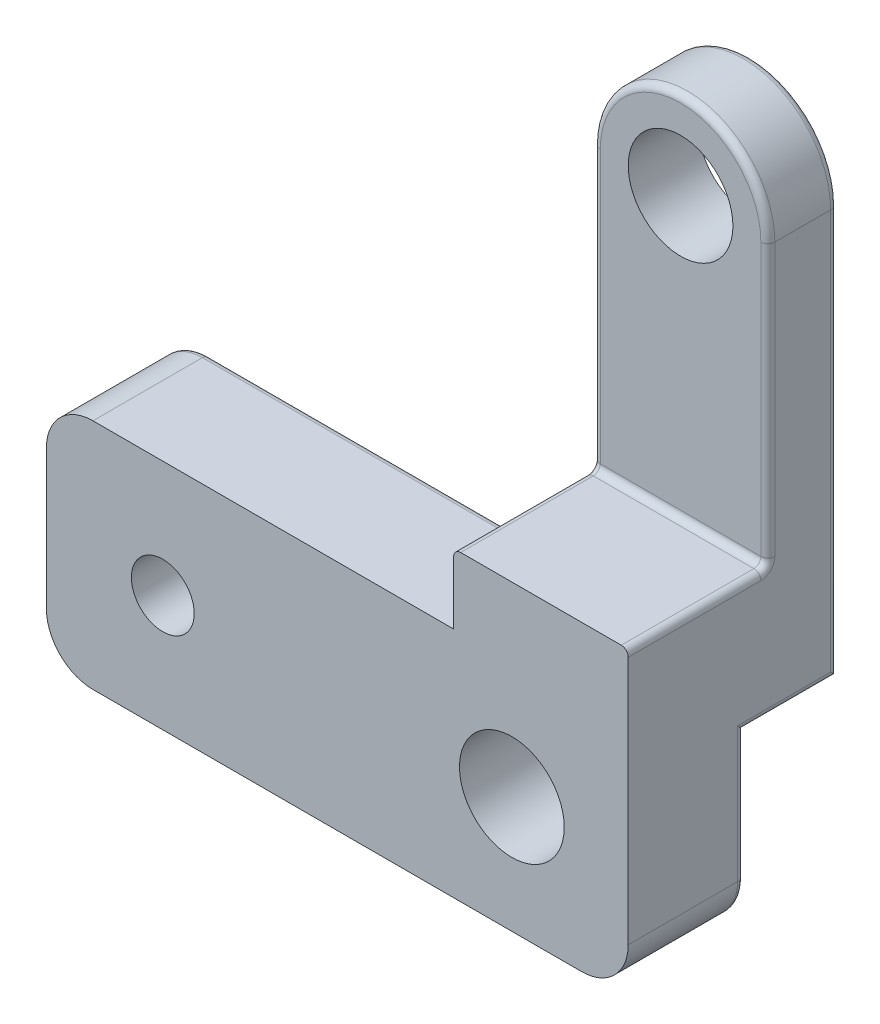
ISO-10303-21;
HEADER;
FILE_DESCRIPTION(('STEP AP214'),'2;1');
FILE_NAME('part.step','',(''),(''),'','','');
FILE_SCHEMA(('AUTOMOTIVE_DESIGN { 1 0 10303 214 1 1 1 1 }'));
ENDSEC;
DATA;
#1=APPLICATION_CONTEXT('core data for automotive mechanical design processes');
#2=APPLICATION_PROTOCOL_DEFINITION('international standard','automotive_design',2000,#1);
#3=PRODUCT_CONTEXT('',#1,'mechanical');
#4=PRODUCT('Part','Part','',(#3));
#5=PRODUCT_RELATED_PRODUCT_CATEGORY('part','',(#4));
#6=PRODUCT_DEFINITION_FORMATION('','',#4);
#7=PRODUCT_DEFINITION_CONTEXT('part definition',#1,'design');
#8=PRODUCT_DEFINITION('design','',#6,#7);
#9=PRODUCT_DEFINITION_SHAPE('','',#8);
#10=(LENGTH_UNIT() NAMED_UNIT(*) SI_UNIT(.MILLI.,.METRE.));
#11=(NAMED_UNIT(*) PLANE_ANGLE_UNIT() SI_UNIT($,.RADIAN.));
#12=(NAMED_UNIT(*) SI_UNIT($,.STERADIAN.) SOLID_ANGLE_UNIT());
#13=UNCERTAINTY_MEASURE_WITH_UNIT(LENGTH_MEASURE(1.E-05),#10,'distance_accuracy_value','');
#14=(GEOMETRIC_REPRESENTATION_CONTEXT(3) GLOBAL_UNCERTAINTY_ASSIGNED_CONTEXT((#13)) GLOBAL_UNIT_ASSIGNED_CONTEXT((#10,
#11,#12)) REPRESENTATION_CONTEXT('',''));
#15=CARTESIAN_POINT('',(0.,0.,0.));
#16=DIRECTION('',(0.,0.,1.));
#17=DIRECTION('',(1.,0.,0.));
#18=AXIS2_PLACEMENT_3D('',#15,#16,#17);
#19=CARTESIAN_POINT('',(6.35,3.175,9.525));
#20=DIRECTION('',(-1.,0.,0.));
#21=DIRECTION('',(0.,0.,-1.));
#22=AXIS2_PLACEMENT_3D('',#19,#20,#21);
#23=PLANE('',#22);
#24=CARTESIAN_POINT('',(6.35,10.541,2.286));
#25=DIRECTION('',(1.,0.,0.));
#26=DIRECTION('',(0.,0.,-1.));
#27=AXIS2_PLACEMENT_3D('',#24,#25,#26);
#28=CIRCLE('',#27,0.762);
#29=CARTESIAN_POINT('',(6.35,9.779,2.286));
#30=VERTEX_POINT('',#29);
#31=CARTESIAN_POINT('',(6.35,10.541,1.524));
#32=VERTEX_POINT('',#31);
#33=EDGE_CURVE('E300',#30,#32,#28,.T.);
#34=ORIENTED_EDGE('',*,*,#33,.T.);
#35=DIRECTION('',(0.,-1.,0.));
#36=VECTOR('',#35,1.);
#37=CARTESIAN_POINT('',(6.35,10.16,1.524));
#38=LINE('',#37,#36);
#39=CARTESIAN_POINT('',(6.35,25.4,1.524));
#40=VERTEX_POINT('',#39);
#41=EDGE_CURVE('E302',#40,#32,#38,.T.);
#42=ORIENTED_EDGE('',*,*,#41,.F.);
#43=DIRECTION('',(0.,0.,-1.));
#44=VECTOR('',#43,1.);
#45=CARTESIAN_POINT('',(6.35,25.4,9.526));
#46=LINE('',#45,#44);
#47=CARTESIAN_POINT('',(6.35,25.4,-1.524));
#48=VERTEX_POINT('',#47);
#49=EDGE_CURVE('E239',#40,#48,#46,.T.);
#50=ORIENTED_EDGE('',*,*,#49,.T.);
#51=DIRECTION('',(0.,-1.,0.));
#52=VECTOR('',#51,1.);
#53=CARTESIAN_POINT('',(6.35000000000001,25.4,-1.524));
#54=LINE('',#53,#52);
#55=CARTESIAN_POINT('',(6.35000000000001,6.12371823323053,-1.524));
#56=VERTEX_POINT('',#55);
#57=EDGE_CURVE('E297',#56,#48,#54,.F.);
#58=ORIENTED_EDGE('',*,*,#57,.F.);
#59=DIRECTION('',(0.,0.,1.));
#60=VECTOR('',#59,1.);
#61=CARTESIAN_POINT('',(6.35,6.12371823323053,9.525));
#62=LINE('',#61,#60);
#63=CARTESIAN_POINT('',(6.35,6.12371823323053,3.20782867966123));
#64=VERTEX_POINT('',#63);
#65=EDGE_CURVE('E295',#64,#56,#62,.F.);
#66=ORIENTED_EDGE('',*,*,#65,.F.);
#67=CARTESIAN_POINT('',(6.35,5.969,3.556));
#68=DIRECTION('',(1.,0.,0.));
#69=DIRECTION('',(0.,0.,-1.));
#70=AXIS2_PLACEMENT_3D('',#67,#68,#69);
#71=CIRCLE('',#70,0.381);
#72=CARTESIAN_POINT('',(6.35,6.35,3.556));
#73=VERTEX_POINT('',#72);
#74=EDGE_CURVE('E42',#73,#64,#71,.F.);
#75=ORIENTED_EDGE('',*,*,#74,.F.);
#76=DIRECTION('',(0.,0.,-1.));
#77=VECTOR('',#76,1.);
#78=CARTESIAN_POINT('',(6.35,6.35,9.525));
#79=LINE('',#78,#77);
#80=CARTESIAN_POINT('',(6.35,6.35,9.525));
#81=VERTEX_POINT('',#80);
#82=EDGE_CURVE('E220',#81,#73,#79,.T.);
#83=ORIENTED_EDGE('',*,*,#82,.F.);
#84=DIRECTION('',(0.,-1.,0.));
#85=VECTOR('',#84,1.);
#86=CARTESIAN_POINT('',(6.35,6.35,9.525));
#87=LINE('',#86,#85);
#88=CARTESIAN_POINT('',(6.35,9.779,9.525));
#89=VERTEX_POINT('',#88);
#90=EDGE_CURVE('E229',#89,#81,#87,.T.);
#91=ORIENTED_EDGE('',*,*,#90,.F.);
#92=DIRECTION('',(0.,0.,-1.));
#93=VECTOR('',#92,1.);
#94=CARTESIAN_POINT('',(6.35,9.779,9.525));
#95=LINE('',#94,#93);
#96=EDGE_CURVE('E305',#30,#89,#95,.F.);
#97=ORIENTED_EDGE('',*,*,#96,.F.);
#98=EDGE_LOOP('',(#34,#42,#50,#58,#66,#75,#83,#91,#97));
#99=FACE_BOUND('',#98,.T.);
#100=ADVANCED_FACE('F32',(#99),#23,.T.);
#101=CARTESIAN_POINT('',(0.,3.175,6.35));
#102=DIRECTION('',(0.,-1.,0.));
#103=DIRECTION('',(0.,0.,1.));
#104=AXIS2_PLACEMENT_3D('',#101,#102,#103);
#105=PLANE('',#104);
#106=DIRECTION('',(-1.,0.,0.));
#107=VECTOR('',#106,1.);
#108=CARTESIAN_POINT('',(0.,3.175,3.175));
#109=LINE('',#108,#107);
#110=CARTESIAN_POINT('',(15.494,3.175,3.175));
#111=VERTEX_POINT('',#110);
#112=CARTESIAN_POINT('',(15.24,3.175,3.175));
#113=VERTEX_POINT('',#112);
#114=EDGE_CURVE('E246',#111,#113,#109,.T.);
#115=ORIENTED_EDGE('',*,*,#114,.T.);
#116=DIRECTION('',(0.,0.,1.));
#117=VECTOR('',#116,1.);
#118=CARTESIAN_POINT('',(15.24,3.175,6.35));
#119=LINE('',#118,#117);
#120=CARTESIAN_POINT('',(15.24,3.175,-1.85233797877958));
#121=VERTEX_POINT('',#120);
#122=EDGE_CURVE('E362',#121,#113,#119,.T.);
#123=ORIENTED_EDGE('',*,*,#122,.F.);
#124=CARTESIAN_POINT('',(15.4601272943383,3.175,-1.905));
#125=CARTESIAN_POINT('',(15.4326635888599,3.175,-1.90501093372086));
#126=CARTESIAN_POINT('',(15.405163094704,3.175,-1.90269112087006));
#127=CARTESIAN_POINT('',(15.3514785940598,3.175,-1.8935706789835));
#128=CARTESIAN_POINT('',(15.3252793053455,3.175,-1.88685962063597));
#129=CARTESIAN_POINT('',(15.2896385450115,3.175,-1.87443106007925));
#130=CARTESIAN_POINT('',(15.2795458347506,3.175,-1.87051977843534));
#131=CARTESIAN_POINT('',(15.2595759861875,3.175,-1.86197162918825));
#132=CARTESIAN_POINT('',(15.2497012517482,3.175,-1.85732914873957));
#133=CARTESIAN_POINT('',(15.24,3.175,-1.8523379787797));
#134=B_SPLINE_CURVE_WITH_KNOTS('',3,(#124,#125,#126,#127,#128,#129,#130,#131,#132,#133),
.UNSPECIFIED.,.F.,.F.,(4,2,2,2,4),(0.,0.0823654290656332,0.16310108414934,0.195551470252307,
0.228264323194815),.UNSPECIFIED.);
#135=CARTESIAN_POINT('',(15.4601272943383,3.175,-1.905));
#136=VERTEX_POINT('',#135);
#137=EDGE_CURVE('E354',#136,#121,#134,.T.);
#138=ORIENTED_EDGE('',*,*,#137,.F.);
#139=DIRECTION('',(1.,0.,0.));
#140=VECTOR('',#139,1.);
#141=CARTESIAN_POINT('',(6.35000000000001,3.175,-1.905));
#142=LINE('',#141,#140);
#143=CARTESIAN_POINT('',(15.494,3.175,-1.905));
#144=VERTEX_POINT('',#143);
#145=EDGE_CURVE('E243',#136,#144,#142,.T.);
#146=ORIENTED_EDGE('',*,*,#145,.T.);
#147=DIRECTION('',(0.,0.,1.));
#148=VECTOR('',#147,1.);
#149=CARTESIAN_POINT('',(15.494,3.175,-1.905));
#150=LINE('',#149,#148);
#151=EDGE_CURVE('E595',#111,#144,#150,.F.);
#152=ORIENTED_EDGE('',*,*,#151,.F.);
#153=EDGE_LOOP('',(#115,#123,#138,#146,#152));
#154=FACE_BOUND('',#153,.T.);
#155=ADVANCED_FACE('F368',(#154),#105,.T.);
#156=CARTESIAN_POINT('',(15.875,-6.35,3.175));
#157=DIRECTION('',(-1.,0.,0.));
#158=DIRECTION('',(0.,0.,-1.));
#159=AXIS2_PLACEMENT_3D('',#156,#157,#158);
#160=PLANE('',#159);
#161=DIRECTION('',(0.,0.,1.));
#162=VECTOR('',#161,1.);
#163=CARTESIAN_POINT('',(15.875,3.556,3.175));
#164=LINE('',#163,#162);
#165=CARTESIAN_POINT('',(15.875,3.556,-1.524));
#166=VERTEX_POINT('',#165);
#167=CARTESIAN_POINT('',(15.875,3.556,3.556));
#168=VERTEX_POINT('',#167);
#169=EDGE_CURVE('E310',#166,#168,#164,.T.);
#170=ORIENTED_EDGE('',*,*,#169,.F.);
#171=DIRECTION('',(0.,-1.,0.));
#172=VECTOR('',#171,1.);
#173=CARTESIAN_POINT('',(15.875,-6.35,-1.524));
#174=LINE('',#173,#172);
#175=CARTESIAN_POINT('',(15.875,25.4,-1.524));
#176=VERTEX_POINT('',#175);
#177=EDGE_CURVE('E313',#176,#166,#174,.T.);
#178=ORIENTED_EDGE('',*,*,#177,.F.);
#179=DIRECTION('',(0.,0.,-1.));
#180=VECTOR('',#179,1.);
#181=CARTESIAN_POINT('',(15.875,25.4,9.526));
#182=LINE('',#181,#180);
#183=CARTESIAN_POINT('',(15.875,25.4,1.524));
#184=VERTEX_POINT('',#183);
#185=EDGE_CURVE('E503',#184,#176,#182,.T.);
#186=ORIENTED_EDGE('',*,*,#185,.F.);
#187=DIRECTION('',(0.,-1.,0.));
#188=VECTOR('',#187,1.);
#189=CARTESIAN_POINT('',(15.875,-6.35,1.524));
#190=LINE('',#189,#188);
#191=CARTESIAN_POINT('',(15.875,10.541,1.524));
#192=VERTEX_POINT('',#191);
#193=EDGE_CURVE('E316',#192,#184,#190,.F.);
#194=ORIENTED_EDGE('',*,*,#193,.F.);
#195=CARTESIAN_POINT('',(15.875,10.541,2.286));
#196=DIRECTION('',(1.,0.,0.));
#197=DIRECTION('',(0.,0.,-1.));
#198=AXIS2_PLACEMENT_3D('',#195,#196,#197);
#199=CIRCLE('',#198,0.762);
#200=CARTESIAN_POINT('',(15.875,9.779,2.286));
#201=VERTEX_POINT('',#200);
#202=EDGE_CURVE('E319',#192,#201,#199,.F.);
#203=ORIENTED_EDGE('',*,*,#202,.T.);
#204=DIRECTION('',(0.,0.,-1.));
#205=VECTOR('',#204,1.);
#206=CARTESIAN_POINT('',(15.875,9.779,1.905));
#207=LINE('',#206,#205);
#208=CARTESIAN_POINT('',(15.875,9.779,9.525));
#209=VERTEX_POINT('',#208);
#210=EDGE_CURVE('E322',#209,#201,#207,.T.);
#211=ORIENTED_EDGE('',*,*,#210,.F.);
#212=DIRECTION('',(0.,1.,0.));
#213=VECTOR('',#212,1.);
#214=CARTESIAN_POINT('',(15.875,-6.35,9.525));
#215=LINE('',#214,#213);
#216=CARTESIAN_POINT('',(15.875,-3.81,9.525));
#217=VERTEX_POINT('',#216);
#218=EDGE_CURVE('E226',#217,#209,#215,.T.);
#219=ORIENTED_EDGE('',*,*,#218,.F.);
#220=DIRECTION('',(0.,0.,1.));
#221=VECTOR('',#220,1.);
#222=CARTESIAN_POINT('',(15.875,-3.81,3.175));
#223=LINE('',#222,#221);
#224=CARTESIAN_POINT('',(15.875,-3.81,3.556));
#225=VERTEX_POINT('',#224);
#226=EDGE_CURVE('E265',#225,#217,#223,.T.);
#227=ORIENTED_EDGE('',*,*,#226,.F.);
#228=DIRECTION('',(0.,1.,0.));
#229=VECTOR('',#228,1.);
#230=CARTESIAN_POINT('',(15.875,-6.35,3.556));
#231=LINE('',#230,#229);
#232=EDGE_CURVE('E565',#168,#225,#231,.F.);
#233=ORIENTED_EDGE('',*,*,#232,.F.);
#234=EDGE_LOOP('',(#170,#178,#186,#194,#203,#211,#219,#227,#233));
#235=FACE_BOUND('',#234,.T.);
#236=ADVANCED_FACE('F373',(#235),#160,.F.);
#237=CARTESIAN_POINT('',(-15.875,6.35,3.175));
#238=DIRECTION('',(0.,-1.,0.));
#239=DIRECTION('',(0.,0.,1.));
#240=AXIS2_PLACEMENT_3D('',#237,#238,#239);
#241=PLANE('',#240);
#242=DIRECTION('',(0.,0.,1.));
#243=VECTOR('',#242,1.);
#244=CARTESIAN_POINT('',(-13.335,6.35,3.175));
#245=LINE('',#244,#243);
#246=CARTESIAN_POINT('',(-13.335,6.35,9.525));
#247=VERTEX_POINT('',#246);
#248=CARTESIAN_POINT('',(-13.335,6.35,3.556));
#249=VERTEX_POINT('',#248);
#250=EDGE_CURVE('E223',#247,#249,#245,.F.);
#251=ORIENTED_EDGE('',*,*,#250,.F.);
#252=DIRECTION('',(-1.,0.,0.));
#253=VECTOR('',#252,1.);
#254=CARTESIAN_POINT('',(-15.875,6.35,9.525));
#255=LINE('',#254,#253);
#256=EDGE_CURVE('E216',#81,#247,#255,.T.);
#257=ORIENTED_EDGE('',*,*,#256,.F.);
#258=ORIENTED_EDGE('',*,*,#82,.T.);
#259=DIRECTION('',(-1.,0.,0.));
#260=VECTOR('',#259,1.);
#261=CARTESIAN_POINT('',(-15.875,6.35,3.556));
#262=LINE('',#261,#260);
#263=EDGE_CURVE('E55',#249,#73,#262,.F.);
#264=ORIENTED_EDGE('',*,*,#263,.F.);
#265=EDGE_LOOP('',(#251,#257,#258,#264));
#266=FACE_BOUND('',#265,.T.);
#267=ADVANCED_FACE('F218',(#266),#241,.F.);
#268=CARTESIAN_POINT('',(-15.875,-6.35,3.175));
#269=DIRECTION('',(1.,0.,0.));
#270=DIRECTION('',(0.,0.,1.));
#271=AXIS2_PLACEMENT_3D('',#268,#269,#270);
#272=PLANE('',#271);
#273=DIRECTION('',(0.,0.,1.));
#274=VECTOR('',#273,1.);
#275=CARTESIAN_POINT('',(-15.875,-3.81,3.175));
#276=LINE('',#275,#274);
#277=CARTESIAN_POINT('',(-15.875,-3.81,9.525));
#278=VERTEX_POINT('',#277);
#279=CARTESIAN_POINT('',(-15.875,-3.81,3.556));
#280=VERTEX_POINT('',#279);
#281=EDGE_CURVE('E283',#278,#280,#276,.F.);
#282=ORIENTED_EDGE('',*,*,#281,.F.);
#283=DIRECTION('',(0.,-1.,0.));
#284=VECTOR('',#283,1.);
#285=CARTESIAN_POINT('',(-15.875,-6.35,9.525));
#286=LINE('',#285,#284);
#287=CARTESIAN_POINT('',(-15.875,3.81,9.525));
#288=VERTEX_POINT('',#287);
#289=EDGE_CURVE('E225',#288,#278,#286,.T.);
#290=ORIENTED_EDGE('',*,*,#289,.F.);
#291=DIRECTION('',(0.,0.,1.));
#292=VECTOR('',#291,1.);
#293=CARTESIAN_POINT('',(-15.875,3.81,3.175));
#294=LINE('',#293,#292);
#295=CARTESIAN_POINT('',(-15.875,3.81,3.556));
#296=VERTEX_POINT('',#295);
#297=EDGE_CURVE('E280',#296,#288,#294,.T.);
#298=ORIENTED_EDGE('',*,*,#297,.F.);
#299=DIRECTION('',(0.,-1.,0.));
#300=VECTOR('',#299,1.);
#301=CARTESIAN_POINT('',(-15.875,-6.35,3.556));
#302=LINE('',#301,#300);
#303=EDGE_CURVE('E577',#280,#296,#302,.F.);
#304=ORIENTED_EDGE('',*,*,#303,.F.);
#305=EDGE_LOOP('',(#282,#290,#298,#304));
#306=FACE_BOUND('',#305,.T.);
#307=ADVANCED_FACE('F393',(#306),#272,.F.);
#308=CARTESIAN_POINT('',(-15.875,-6.35,3.175));
#309=DIRECTION('',(0.,1.,0.));
#310=DIRECTION('',(0.,0.,-1.));
#311=AXIS2_PLACEMENT_3D('',#308,#309,#310);
#312=PLANE('',#311);
#313=DIRECTION('',(0.,0.,1.));
#314=VECTOR('',#313,1.);
#315=CARTESIAN_POINT('',(13.335,-6.35,3.175));
#316=LINE('',#315,#314);
#317=CARTESIAN_POINT('',(13.335,-6.35,9.525));
#318=VERTEX_POINT('',#317);
#319=CARTESIAN_POINT('',(13.335,-6.35,3.556));
#320=VERTEX_POINT('',#319);
#321=EDGE_CURVE('E277',#318,#320,#316,.F.);
#322=ORIENTED_EDGE('',*,*,#321,.F.);
#323=DIRECTION('',(1.,0.,0.));
#324=VECTOR('',#323,1.);
#325=CARTESIAN_POINT('',(-15.875,-6.35,9.525));
#326=LINE('',#325,#324);
#327=CARTESIAN_POINT('',(-13.335,-6.35,9.525));
#328=VERTEX_POINT('',#327);
#329=EDGE_CURVE('E262',#328,#318,#326,.T.);
#330=ORIENTED_EDGE('',*,*,#329,.F.);
#331=DIRECTION('',(0.,0.,1.));
#332=VECTOR('',#331,1.);
#333=CARTESIAN_POINT('',(-13.335,-6.35,3.175));
#334=LINE('',#333,#332);
#335=CARTESIAN_POINT('',(-13.335,-6.35,3.556));
#336=VERTEX_POINT('',#335);
#337=EDGE_CURVE('E274',#336,#328,#334,.T.);
#338=ORIENTED_EDGE('',*,*,#337,.F.);
#339=DIRECTION('',(1.,0.,0.));
#340=VECTOR('',#339,1.);
#341=CARTESIAN_POINT('',(-15.875,-6.35,3.556));
#342=LINE('',#341,#340);
#343=EDGE_CURVE('E571',#320,#336,#342,.F.);
#344=ORIENTED_EDGE('',*,*,#343,.F.);
#345=EDGE_LOOP('',(#322,#330,#338,#344));
#346=FACE_BOUND('',#345,.T.);
#347=ADVANCED_FACE('F386',(#346),#312,.F.);
#348=CARTESIAN_POINT('',(0.,0.,3.175));
#349=DIRECTION('',(0.,0.,1.));
#350=DIRECTION('',(-1.,0.,0.));
#351=AXIS2_PLACEMENT_3D('',#348,#349,#350);
#352=PLANE('',#351);
#353=CARTESIAN_POINT('',(9.525,0.,3.175));
#354=DIRECTION('',(0.,0.,-1.));
#355=DIRECTION('',(-1.,0.,0.));
#356=AXIS2_PLACEMENT_3D('',#353,#354,#355);
#357=CIRCLE('',#356,2.8575);
#358=CARTESIAN_POINT('',(6.6675,0.,3.175));
#359=VERTEX_POINT('',#358);
#360=EDGE_CURVE('E489',#359,#359,#357,.T.);
#361=ORIENTED_EDGE('',*,*,#360,.F.);
#362=EDGE_LOOP('',(#361));
#363=FACE_BOUND('',#362,.T.);
#364=CARTESIAN_POINT('',(13.335,-3.81,3.175));
#365=DIRECTION('',(0.,0.,-1.));
#366=DIRECTION('',(-1.,0.,0.));
#367=AXIS2_PLACEMENT_3D('',#364,#365,#366);
#368=CIRCLE('',#367,2.159);
#369=CARTESIAN_POINT('',(13.335,-5.969,3.175));
#370=VERTEX_POINT('',#369);
#371=CARTESIAN_POINT('',(15.494,-3.81,3.175));
#372=VERTEX_POINT('',#371);
#373=EDGE_CURVE('E559',#370,#372,#368,.F.);
#374=ORIENTED_EDGE('',*,*,#373,.F.);
#375=DIRECTION('',(1.,0.,0.));
#376=VECTOR('',#375,1.);
#377=CARTESIAN_POINT('',(0.,-5.969,3.175));
#378=LINE('',#377,#376);
#379=CARTESIAN_POINT('',(-13.335,-5.969,3.175));
#380=VERTEX_POINT('',#379);
#381=EDGE_CURVE('E556',#380,#370,#378,.T.);
#382=ORIENTED_EDGE('',*,*,#381,.F.);
#383=CARTESIAN_POINT('',(-13.335,-3.81,3.175));
#384=DIRECTION('',(0.,0.,-1.));
#385=DIRECTION('',(-1.,0.,0.));
#386=AXIS2_PLACEMENT_3D('',#383,#384,#385);
#387=CIRCLE('',#386,2.159);
#388=CARTESIAN_POINT('',(-15.494,-3.81,3.175));
#389=VERTEX_POINT('',#388);
#390=EDGE_CURVE('E553',#389,#380,#387,.F.);
#391=ORIENTED_EDGE('',*,*,#390,.F.);
#392=DIRECTION('',(0.,-1.,0.));
#393=VECTOR('',#392,1.);
#394=CARTESIAN_POINT('',(-15.494,0.,3.175));
#395=LINE('',#394,#393);
#396=CARTESIAN_POINT('',(-15.494,3.81,3.175));
#397=VERTEX_POINT('',#396);
#398=EDGE_CURVE('E550',#397,#389,#395,.T.);
#399=ORIENTED_EDGE('',*,*,#398,.F.);
#400=CARTESIAN_POINT('',(-13.335,3.81,3.175));
#401=DIRECTION('',(0.,0.,-1.));
#402=DIRECTION('',(-1.,0.,0.));
#403=AXIS2_PLACEMENT_3D('',#400,#401,#402);
#404=CIRCLE('',#403,2.159);
#405=CARTESIAN_POINT('',(-13.335,5.969,3.175));
#406=VERTEX_POINT('',#405);
#407=EDGE_CURVE('E547',#406,#397,#404,.F.);
#408=ORIENTED_EDGE('',*,*,#407,.F.);
#409=DIRECTION('',(-1.,0.,0.));
#410=VECTOR('',#409,1.);
#411=CARTESIAN_POINT('',(0.,5.969,3.175));
#412=LINE('',#411,#410);
#413=CARTESIAN_POINT('',(6.38282867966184,5.969,3.175));
#414=VERTEX_POINT('',#413);
#415=EDGE_CURVE('E545',#414,#406,#412,.T.);
#416=ORIENTED_EDGE('',*,*,#415,.F.);
#417=CARTESIAN_POINT('',(6.73100000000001,6.12371823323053,3.175));
#418=DIRECTION('',(0.,0.,-1.));
#419=DIRECTION('',(-1.,0.,0.));
#420=AXIS2_PLACEMENT_3D('',#417,#418,#419);
#421=CIRCLE('',#420,0.381);
#422=CARTESIAN_POINT('',(6.88915094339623,5.77709267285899,3.175));
#423=VERTEX_POINT('',#422);
#424=EDGE_CURVE('E548',#423,#414,#421,.T.);
#425=ORIENTED_EDGE('',*,*,#424,.F.);
#426=CARTESIAN_POINT('',(9.525,0.,3.175));
#427=DIRECTION('',(0.,0.,1.));
#428=DIRECTION('',(1.,0.,0.));
#429=AXIS2_PLACEMENT_3D('',#426,#427,#428);
#430=CIRCLE('',#429,6.35);
#431=CARTESIAN_POINT('',(14.9165094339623,3.35471698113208,3.175));
#432=VERTEX_POINT('',#431);
#433=EDGE_CURVE('E500',#432,#423,#430,.T.);
#434=ORIENTED_EDGE('',*,*,#433,.F.);
#435=CARTESIAN_POINT('',(15.24,3.556,3.175));
#436=DIRECTION('',(0.,0.,-1.));
#437=DIRECTION('',(-1.,0.,0.));
#438=AXIS2_PLACEMENT_3D('',#435,#436,#437);
#439=CIRCLE('',#438,0.381);
#440=EDGE_CURVE('E601',#113,#432,#439,.T.);
#441=ORIENTED_EDGE('',*,*,#440,.F.);
#442=ORIENTED_EDGE('',*,*,#114,.F.);
#443=DIRECTION('',(0.,1.,0.));
#444=VECTOR('',#443,1.);
#445=CARTESIAN_POINT('',(15.494,0.,3.175));
#446=LINE('',#445,#444);
#447=EDGE_CURVE('E562',#372,#111,#446,.T.);
#448=ORIENTED_EDGE('',*,*,#447,.F.);
#449=EDGE_LOOP('',(#374,#382,#391,#399,#408,#416,#425,#434,#441,#442,#448));
#450=FACE_BOUND('',#449,.T.);
#451=CARTESIAN_POINT('',(-9.525,0.,3.175));
#452=DIRECTION('',(0.,0.,1.));
#453=DIRECTION('',(1.,0.,0.));
#454=AXIS2_PLACEMENT_3D('',#451,#452,#453);
#455=CIRCLE('',#454,1.7145);
#456=CARTESIAN_POINT('',(-7.8105,0.,3.175));
#457=VERTEX_POINT('',#456);
#458=EDGE_CURVE('E253',#457,#457,#455,.T.);
#459=ORIENTED_EDGE('',*,*,#458,.T.);
#460=EDGE_LOOP('',(#459));
#461=FACE_BOUND('',#460,.T.);
#462=ADVANCED_FACE('F383',(#363,#450,#461),#352,.F.);
#463=CARTESIAN_POINT('',(0.,0.,9.525));
#464=DIRECTION('',(0.,0.,1.));
#465=DIRECTION('',(-1.,0.,0.));
#466=AXIS2_PLACEMENT_3D('',#463,#464,#465);
#467=PLANE('',#466);
#468=CARTESIAN_POINT('',(9.525,0.,9.525));
#469=DIRECTION('',(0.,0.,1.));
#470=DIRECTION('',(1.,0.,0.));
#471=AXIS2_PLACEMENT_3D('',#468,#469,#470);
#472=CIRCLE('',#471,2.8575);
#473=CARTESIAN_POINT('',(12.3825,0.,9.525));
#474=VERTEX_POINT('',#473);
#475=EDGE_CURVE('E486',#474,#474,#472,.T.);
#476=ORIENTED_EDGE('',*,*,#475,.F.);
#477=EDGE_LOOP('',(#476));
#478=FACE_BOUND('',#477,.T.);
#479=ORIENTED_EDGE('',*,*,#90,.T.);
#480=ORIENTED_EDGE('',*,*,#256,.T.);
#481=CARTESIAN_POINT('',(-13.335,3.81,9.525));
#482=DIRECTION('',(0.,0.,-1.));
#483=DIRECTION('',(-1.,0.,0.));
#484=AXIS2_PLACEMENT_3D('',#481,#482,#483);
#485=CIRCLE('',#484,2.54);
#486=EDGE_CURVE('E268',#288,#247,#485,.T.);
#487=ORIENTED_EDGE('',*,*,#486,.F.);
#488=ORIENTED_EDGE('',*,*,#289,.T.);
#489=CARTESIAN_POINT('',(-13.335,-3.81,9.525));
#490=DIRECTION('',(0.,0.,-1.));
#491=DIRECTION('',(-1.,0.,0.));
#492=AXIS2_PLACEMENT_3D('',#489,#490,#491);
#493=CIRCLE('',#492,2.54);
#494=EDGE_CURVE('E270',#328,#278,#493,.T.);
#495=ORIENTED_EDGE('',*,*,#494,.F.);
#496=ORIENTED_EDGE('',*,*,#329,.T.);
#497=CARTESIAN_POINT('',(13.335,-3.81,9.525));
#498=DIRECTION('',(0.,0.,-1.));
#499=DIRECTION('',(-1.,0.,0.));
#500=AXIS2_PLACEMENT_3D('',#497,#498,#499);
#501=CIRCLE('',#500,2.54);
#502=EDGE_CURVE('E272',#217,#318,#501,.T.);
#503=ORIENTED_EDGE('',*,*,#502,.F.);
#504=ORIENTED_EDGE('',*,*,#218,.T.);
#505=CARTESIAN_POINT('',(15.494,9.779,9.525));
#506=DIRECTION('',(0.,0.,-1.));
#507=DIRECTION('',(-1.,0.,0.));
#508=AXIS2_PLACEMENT_3D('',#505,#506,#507);
#509=CIRCLE('',#508,0.381);
#510=CARTESIAN_POINT('',(15.494,10.16,9.525));
#511=VERTEX_POINT('',#510);
#512=EDGE_CURVE('E307',#511,#209,#509,.T.);
#513=ORIENTED_EDGE('',*,*,#512,.F.);
#514=DIRECTION('',(-1.,0.,0.));
#515=VECTOR('',#514,1.);
#516=CARTESIAN_POINT('',(6.35,10.16,9.525));
#517=LINE('',#516,#515);
#518=CARTESIAN_POINT('',(6.731,10.16,9.525));
#519=VERTEX_POINT('',#518);
#520=EDGE_CURVE('E238',#511,#519,#517,.T.);
#521=ORIENTED_EDGE('',*,*,#520,.T.);
#522=CARTESIAN_POINT('',(6.731,9.779,9.525));
#523=DIRECTION('',(0.,0.,-1.));
#524=DIRECTION('',(-1.,0.,0.));
#525=AXIS2_PLACEMENT_3D('',#522,#523,#524);
#526=CIRCLE('',#525,0.381);
#527=EDGE_CURVE('E234',#89,#519,#526,.T.);
#528=ORIENTED_EDGE('',*,*,#527,.F.);
#529=EDGE_LOOP('',(#479,#480,#487,#488,#495,#496,#503,#504,#513,#521,#528));
#530=FACE_BOUND('',#529,.T.);
#531=CARTESIAN_POINT('',(-9.525,0.,9.525));
#532=DIRECTION('',(0.,0.,-1.));
#533=DIRECTION('',(-1.,0.,0.));
#534=AXIS2_PLACEMENT_3D('',#531,#532,#533);
#535=CIRCLE('',#534,1.7145);
#536=CARTESIAN_POINT('',(-11.2395,0.,9.525));
#537=VERTEX_POINT('',#536);
#538=EDGE_CURVE('E252',#537,#537,#535,.F.);
#539=ORIENTED_EDGE('',*,*,#538,.F.);
#540=EDGE_LOOP('',(#539));
#541=FACE_BOUND('',#540,.T.);
#542=ADVANCED_FACE('F230',(#478,#530,#541),#467,.T.);
#543=CARTESIAN_POINT('',(-9.525,0.,9.526));
#544=DIRECTION('',(0.,0.,-1.));
#545=DIRECTION('',(1.,0.,0.));
#546=AXIS2_PLACEMENT_3D('',#543,#544,#545);
#547=CYLINDRICAL_SURFACE('',#546,1.7145);
#548=ORIENTED_EDGE('',*,*,#538,.T.);
#549=EDGE_LOOP('',(#548));
#550=FACE_BOUND('',#549,.T.);
#551=ORIENTED_EDGE('',*,*,#458,.F.);
#552=EDGE_LOOP('',(#551));
#553=FACE_BOUND('',#552,.T.);
#554=ADVANCED_FACE('F379',(#550,#553),#547,.F.);
#555=CARTESIAN_POINT('',(6.35000000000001,31.75,-1.905));
#556=DIRECTION('',(0.,0.,1.));
#557=DIRECTION('',(-1.,0.,0.));
#558=AXIS2_PLACEMENT_3D('',#555,#556,#557);
#559=PLANE('',#558);
#560=CARTESIAN_POINT('',(11.1125,25.4,-1.905));
#561=DIRECTION('',(0.,0.,1.));
#562=DIRECTION('',(1.,0.,0.));
#563=AXIS2_PLACEMENT_3D('',#560,#561,#562);
#564=CIRCLE('',#563,2.8575);
#565=CARTESIAN_POINT('',(13.97,25.4,-1.905));
#566=VERTEX_POINT('',#565);
#567=EDGE_CURVE('E494',#566,#566,#564,.T.);
#568=ORIENTED_EDGE('',*,*,#567,.T.);
#569=EDGE_LOOP('',(#568));
#570=FACE_BOUND('',#569,.T.);
#571=ORIENTED_EDGE('',*,*,#145,.F.);
#572=CARTESIAN_POINT('',(9.525,0.,-1.905));
#573=DIRECTION('',(0.,0.,-1.));
#574=DIRECTION('',(-1.,0.,0.));
#575=AXIS2_PLACEMENT_3D('',#572,#573,#574);
#576=CIRCLE('',#575,6.731);
#577=CARTESIAN_POINT('',(6.73100000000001,6.12371823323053,-1.905));
#578=VERTEX_POINT('',#577);
#579=EDGE_CURVE('E343',#578,#136,#576,.T.);
#580=ORIENTED_EDGE('',*,*,#579,.F.);
#581=DIRECTION('',(0.,-1.,0.));
#582=VECTOR('',#581,1.);
#583=CARTESIAN_POINT('',(6.73100000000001,5.49926131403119,-1.905));
#584=LINE('',#583,#582);
#585=CARTESIAN_POINT('',(6.73100000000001,25.4,-1.905));
#586=VERTEX_POINT('',#585);
#587=EDGE_CURVE('E345',#586,#578,#584,.T.);
#588=ORIENTED_EDGE('',*,*,#587,.F.);
#589=CARTESIAN_POINT('',(11.1125,25.4,-1.905));
#590=DIRECTION('',(0.,0.,-1.));
#591=DIRECTION('',(-1.,0.,0.));
#592=AXIS2_PLACEMENT_3D('',#589,#590,#591);
#593=CIRCLE('',#592,4.3815);
#594=CARTESIAN_POINT('',(15.494,25.4,-1.905));
#595=VERTEX_POINT('',#594);
#596=EDGE_CURVE('E348',#595,#586,#593,.F.);
#597=ORIENTED_EDGE('',*,*,#596,.F.);
#598=DIRECTION('',(0.,-1.,0.));
#599=VECTOR('',#598,1.);
#600=CARTESIAN_POINT('',(15.494,31.75,-1.905));
#601=LINE('',#600,#599);
#602=EDGE_CURVE('E351',#144,#595,#601,.F.);
#603=ORIENTED_EDGE('',*,*,#602,.F.);
#604=EDGE_LOOP('',(#571,#580,#588,#597,#603));
#605=FACE_BOUND('',#604,.T.);
#606=ADVANCED_FACE('F375',(#570,#605),#559,.F.);
#607=CARTESIAN_POINT('',(6.35,31.75,1.905));
#608=DIRECTION('',(0.,0.,-1.));
#609=DIRECTION('',(1.,0.,0.));
#610=AXIS2_PLACEMENT_3D('',#607,#608,#609);
#611=PLANE('',#610);
#612=CARTESIAN_POINT('',(11.1125,25.4,1.905));
#613=DIRECTION('',(0.,0.,1.));
#614=DIRECTION('',(1.,0.,0.));
#615=AXIS2_PLACEMENT_3D('',#612,#613,#614);
#616=CIRCLE('',#615,2.8575);
#617=CARTESIAN_POINT('',(13.97,25.4,1.905));
#618=VERTEX_POINT('',#617);
#619=EDGE_CURVE('E499',#618,#618,#616,.T.);
#620=ORIENTED_EDGE('',*,*,#619,.F.);
#621=EDGE_LOOP('',(#620));
#622=FACE_BOUND('',#621,.T.);
#623=DIRECTION('',(-1.,0.,0.));
#624=VECTOR('',#623,1.);
#625=CARTESIAN_POINT('',(6.35,10.541,1.905));
#626=LINE('',#625,#624);
#627=CARTESIAN_POINT('',(15.494,10.541,1.905));
#628=VERTEX_POINT('',#627);
#629=CARTESIAN_POINT('',(6.73100000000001,10.541,1.905));
#630=VERTEX_POINT('',#629);
#631=EDGE_CURVE('E328',#628,#630,#626,.T.);
#632=ORIENTED_EDGE('',*,*,#631,.F.);
#633=DIRECTION('',(0.,-1.,0.));
#634=VECTOR('',#633,1.);
#635=CARTESIAN_POINT('',(15.494,31.75,1.905));
#636=LINE('',#635,#634);
#637=CARTESIAN_POINT('',(15.494,25.4,1.905));
#638=VERTEX_POINT('',#637);
#639=EDGE_CURVE('E325',#638,#628,#636,.T.);
#640=ORIENTED_EDGE('',*,*,#639,.F.);
#641=CARTESIAN_POINT('',(11.1125,25.4,1.905));
#642=DIRECTION('',(0.,0.,1.));
#643=DIRECTION('',(1.,0.,0.));
#644=AXIS2_PLACEMENT_3D('',#641,#642,#643);
#645=CIRCLE('',#644,4.3815);
#646=CARTESIAN_POINT('',(6.731,25.4,1.905));
#647=VERTEX_POINT('',#646);
#648=EDGE_CURVE('E331',#647,#638,#645,.F.);
#649=ORIENTED_EDGE('',*,*,#648,.F.);
#650=DIRECTION('',(0.,-1.,0.));
#651=VECTOR('',#650,1.);
#652=CARTESIAN_POINT('',(6.73100000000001,25.4,1.905));
#653=LINE('',#652,#651);
#654=EDGE_CURVE('E334',#630,#647,#653,.F.);
#655=ORIENTED_EDGE('',*,*,#654,.F.);
#656=EDGE_LOOP('',(#632,#640,#649,#655));
#657=FACE_BOUND('',#656,.T.);
#658=ADVANCED_FACE('F638',(#622,#657),#611,.F.);
#659=CARTESIAN_POINT('',(6.35,10.16,9.525));
#660=DIRECTION('',(0.,1.,0.));
#661=DIRECTION('',(0.,0.,-1.));
#662=AXIS2_PLACEMENT_3D('',#659,#660,#661);
#663=PLANE('',#662);
#664=ORIENTED_EDGE('',*,*,#520,.F.);
#665=DIRECTION('',(0.,0.,-1.));
#666=VECTOR('',#665,1.);
#667=CARTESIAN_POINT('',(15.494,10.16,9.525));
#668=LINE('',#667,#666);
#669=CARTESIAN_POINT('',(15.494,10.16,2.286));
#670=VERTEX_POINT('',#669);
#671=EDGE_CURVE('E290',#670,#511,#668,.F.);
#672=ORIENTED_EDGE('',*,*,#671,.F.);
#673=DIRECTION('',(-1.,0.,0.));
#674=VECTOR('',#673,1.);
#675=CARTESIAN_POINT('',(6.35,10.16,2.286));
#676=LINE('',#675,#674);
#677=CARTESIAN_POINT('',(6.73100000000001,10.16,2.286));
#678=VERTEX_POINT('',#677);
#679=EDGE_CURVE('E287',#678,#670,#676,.F.);
#680=ORIENTED_EDGE('',*,*,#679,.F.);
#681=DIRECTION('',(0.,0.,-1.));
#682=VECTOR('',#681,1.);
#683=CARTESIAN_POINT('',(6.731,10.16,9.525));
#684=LINE('',#683,#682);
#685=EDGE_CURVE('E292',#519,#678,#684,.T.);
#686=ORIENTED_EDGE('',*,*,#685,.F.);
#687=EDGE_LOOP('',(#664,#672,#680,#686));
#688=FACE_BOUND('',#687,.T.);
#689=ADVANCED_FACE('F629',(#688),#663,.T.);
#690=CARTESIAN_POINT('',(11.1125,25.4,9.526));
#691=DIRECTION('',(0.,0.,-1.));
#692=DIRECTION('',(1.,0.,0.));
#693=AXIS2_PLACEMENT_3D('',#690,#691,#692);
#694=CYLINDRICAL_SURFACE('',#693,4.7625);
#695=ORIENTED_EDGE('',*,*,#185,.T.);
#696=CARTESIAN_POINT('',(11.1125,25.4,-1.524));
#697=DIRECTION('',(0.,0.,-1.));
#698=DIRECTION('',(-1.,0.,0.));
#699=AXIS2_PLACEMENT_3D('',#696,#697,#698);
#700=CIRCLE('',#699,4.7625);
#701=EDGE_CURVE('E337',#48,#176,#700,.T.);
#702=ORIENTED_EDGE('',*,*,#701,.F.);
#703=ORIENTED_EDGE('',*,*,#49,.F.);
#704=CARTESIAN_POINT('',(11.1125,25.4,1.524));
#705=DIRECTION('',(0.,0.,1.));
#706=DIRECTION('',(1.,0.,0.));
#707=AXIS2_PLACEMENT_3D('',#704,#705,#706);
#708=CIRCLE('',#707,4.7625);
#709=EDGE_CURVE('E340',#184,#40,#708,.T.);
#710=ORIENTED_EDGE('',*,*,#709,.F.);
#711=EDGE_LOOP('',(#695,#702,#703,#710));
#712=FACE_BOUND('',#711,.T.);
#713=ADVANCED_FACE('F407',(#712),#694,.T.);
#714=CARTESIAN_POINT('',(13.335,-3.81,3.175));
#715=DIRECTION('',(0.,0.,1.));
#716=DIRECTION('',(-1.,0.,0.));
#717=AXIS2_PLACEMENT_3D('',#714,#715,#716);
#718=CYLINDRICAL_SURFACE('',#717,2.54);
#719=ORIENTED_EDGE('',*,*,#226,.T.);
#720=ORIENTED_EDGE('',*,*,#502,.T.);
#721=ORIENTED_EDGE('',*,*,#321,.T.);
#722=CARTESIAN_POINT('',(13.335,-3.81,3.556));
#723=DIRECTION('',(0.,0.,-1.));
#724=DIRECTION('',(-1.,0.,0.));
#725=AXIS2_PLACEMENT_3D('',#722,#723,#724);
#726=CIRCLE('',#725,2.54);
#727=EDGE_CURVE('E568',#225,#320,#726,.T.);
#728=ORIENTED_EDGE('',*,*,#727,.F.);
#729=EDGE_LOOP('',(#719,#720,#721,#728));
#730=FACE_BOUND('',#729,.T.);
#731=ADVANCED_FACE('F403',(#730),#718,.T.);
#732=CARTESIAN_POINT('',(-13.335,-3.81,3.175));
#733=DIRECTION('',(0.,0.,1.));
#734=DIRECTION('',(-1.,0.,0.));
#735=AXIS2_PLACEMENT_3D('',#732,#733,#734);
#736=CYLINDRICAL_SURFACE('',#735,2.54);
#737=ORIENTED_EDGE('',*,*,#337,.T.);
#738=ORIENTED_EDGE('',*,*,#494,.T.);
#739=ORIENTED_EDGE('',*,*,#281,.T.);
#740=CARTESIAN_POINT('',(-13.335,-3.81,3.556));
#741=DIRECTION('',(0.,0.,-1.));
#742=DIRECTION('',(-1.,0.,0.));
#743=AXIS2_PLACEMENT_3D('',#740,#741,#742);
#744=CIRCLE('',#743,2.54);
#745=EDGE_CURVE('E574',#336,#280,#744,.T.);
#746=ORIENTED_EDGE('',*,*,#745,.F.);
#747=EDGE_LOOP('',(#737,#738,#739,#746));
#748=FACE_BOUND('',#747,.T.);
#749=ADVANCED_FACE('F406',(#748),#736,.T.);
#750=CARTESIAN_POINT('',(-13.335,3.81,3.175));
#751=DIRECTION('',(0.,0.,1.));
#752=DIRECTION('',(-1.,0.,0.));
#753=AXIS2_PLACEMENT_3D('',#750,#751,#752);
#754=CYLINDRICAL_SURFACE('',#753,2.54);
#755=ORIENTED_EDGE('',*,*,#297,.T.);
#756=ORIENTED_EDGE('',*,*,#486,.T.);
#757=ORIENTED_EDGE('',*,*,#250,.T.);
#758=CARTESIAN_POINT('',(-13.335,3.81,3.556));
#759=DIRECTION('',(0.,0.,-1.));
#760=DIRECTION('',(-1.,0.,0.));
#761=AXIS2_PLACEMENT_3D('',#758,#759,#760);
#762=CIRCLE('',#761,2.54);
#763=EDGE_CURVE('E580',#296,#249,#762,.T.);
#764=ORIENTED_EDGE('',*,*,#763,.F.);
#765=EDGE_LOOP('',(#755,#756,#757,#764));
#766=FACE_BOUND('',#765,.T.);
#767=ADVANCED_FACE('F411',(#766),#754,.T.);
#768=CARTESIAN_POINT('',(9.525,0.,-1.906));
#769=DIRECTION('',(0.,0.,1.));
#770=DIRECTION('',(-1.,0.,0.));
#771=AXIS2_PLACEMENT_3D('',#768,#769,#770);
#772=CYLINDRICAL_SURFACE('',#771,6.35);
#773=ORIENTED_EDGE('',*,*,#433,.T.);
#774=DIRECTION('',(0.,0.,1.));
#775=VECTOR('',#774,1.);
#776=CARTESIAN_POINT('',(6.88915094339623,5.77709267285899,-1.906));
#777=LINE('',#776,#775);
#778=CARTESIAN_POINT('',(6.88915094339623,5.77709267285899,-1.524));
#779=VERTEX_POINT('',#778);
#780=EDGE_CURVE('E588',#779,#423,#777,.T.);
#781=ORIENTED_EDGE('',*,*,#780,.F.);
#782=CARTESIAN_POINT('',(9.525,0.,-1.524));
#783=DIRECTION('',(0.,0.,-1.));
#784=DIRECTION('',(-1.,0.,0.));
#785=AXIS2_PLACEMENT_3D('',#782,#783,#784);
#786=CIRCLE('',#785,6.35);
#787=CARTESIAN_POINT('',(14.9165094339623,3.35471698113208,-1.524));
#788=VERTEX_POINT('',#787);
#789=EDGE_CURVE('E592',#788,#779,#786,.F.);
#790=ORIENTED_EDGE('',*,*,#789,.F.);
#791=DIRECTION('',(0.,0.,1.));
#792=VECTOR('',#791,1.);
#793=CARTESIAN_POINT('',(14.9165094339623,3.35471698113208,-1.906));
#794=LINE('',#793,#792);
#795=EDGE_CURVE('E599',#432,#788,#794,.F.);
#796=ORIENTED_EDGE('',*,*,#795,.F.);
#797=EDGE_LOOP('',(#773,#781,#790,#796));
#798=FACE_BOUND('',#797,.T.);
#799=ADVANCED_FACE('F415',(#798),#772,.F.);
#800=CARTESIAN_POINT('',(15.494,9.779,3.175));
#801=DIRECTION('',(0.,0.,1.));
#802=DIRECTION('',(-1.,0.,0.));
#803=AXIS2_PLACEMENT_3D('',#800,#801,#802);
#804=CYLINDRICAL_SURFACE('',#803,0.381);
#805=ORIENTED_EDGE('',*,*,#512,.T.);
#806=ORIENTED_EDGE('',*,*,#210,.T.);
#807=CARTESIAN_POINT('',(15.494,9.779,2.286));
#808=DIRECTION('',(0.,0.,1.));
#809=DIRECTION('',(1.,0.,0.));
#810=AXIS2_PLACEMENT_3D('',#807,#808,#809);
#811=CIRCLE('',#810,0.381);
#812=EDGE_CURVE('E504',#201,#670,#811,.T.);
#813=ORIENTED_EDGE('',*,*,#812,.T.);
#814=ORIENTED_EDGE('',*,*,#671,.T.);
#815=EDGE_LOOP('',(#805,#806,#813,#814));
#816=FACE_BOUND('',#815,.T.);
#817=ADVANCED_FACE('F445',(#816),#804,.T.);
#818=CARTESIAN_POINT('',(15.494,31.75,1.524));
#819=DIRECTION('',(0.,-1.,0.));
#820=DIRECTION('',(0.,0.,1.));
#821=AXIS2_PLACEMENT_3D('',#818,#819,#820);
#822=CYLINDRICAL_SURFACE('',#821,0.381);
#823=CARTESIAN_POINT('',(15.494,25.4,1.524));
#824=DIRECTION('',(0.,-1.,0.));
#825=DIRECTION('',(0.,0.,-1.));
#826=AXIS2_PLACEMENT_3D('',#823,#824,#825);
#827=CIRCLE('',#826,0.381);
#828=EDGE_CURVE('E617',#184,#638,#827,.T.);
#829=ORIENTED_EDGE('',*,*,#828,.T.);
#830=ORIENTED_EDGE('',*,*,#639,.T.);
#831=CARTESIAN_POINT('',(15.494,10.541,1.524));
#832=DIRECTION('',(0.,1.,0.));
#833=DIRECTION('',(0.,0.,1.));
#834=AXIS2_PLACEMENT_3D('',#831,#832,#833);
#835=CIRCLE('',#834,0.381);
#836=EDGE_CURVE('E619',#628,#192,#835,.T.);
#837=ORIENTED_EDGE('',*,*,#836,.T.);
#838=ORIENTED_EDGE('',*,*,#193,.T.);
#839=EDGE_LOOP('',(#829,#830,#837,#838));
#840=FACE_BOUND('',#839,.T.);
#841=ADVANCED_FACE('F441',(#840),#822,.T.);
#842=CARTESIAN_POINT('',(15.494,10.541,2.286));
#843=DIRECTION('',(-1.,0.,0.));
#844=DIRECTION('',(0.,0.,-1.));
#845=AXIS2_PLACEMENT_3D('',#842,#843,#844);
#846=TOROIDAL_SURFACE('',#845,0.762,0.381);
#847=ORIENTED_EDGE('',*,*,#202,.F.);
#848=ORIENTED_EDGE('',*,*,#836,.F.);
#849=CARTESIAN_POINT('',(15.494,10.541,2.286));
#850=DIRECTION('',(1.,0.,0.));
#851=DIRECTION('',(0.,0.,-1.));
#852=AXIS2_PLACEMENT_3D('',#849,#850,#851);
#853=CIRCLE('',#852,0.381);
#854=EDGE_CURVE('E615',#628,#670,#853,.F.);
#855=ORIENTED_EDGE('',*,*,#854,.T.);
#856=ORIENTED_EDGE('',*,*,#812,.F.);
#857=EDGE_LOOP('',(#847,#848,#855,#856));
#858=FACE_BOUND('',#857,.T.);
#859=ADVANCED_FACE('F437',(#858),#846,.T.);
#860=CARTESIAN_POINT('',(11.1125,25.4,1.524));
#861=DIRECTION('',(0.,0.,-1.));
#862=DIRECTION('',(1.,0.,0.));
#863=AXIS2_PLACEMENT_3D('',#860,#861,#862);
#864=TOROIDAL_SURFACE('',#863,4.3815,0.381);
#865=ORIENTED_EDGE('',*,*,#828,.F.);
#866=ORIENTED_EDGE('',*,*,#709,.T.);
#867=CARTESIAN_POINT('',(6.731,25.4,1.524));
#868=DIRECTION('',(0.,1.,0.));
#869=DIRECTION('',(0.,0.,1.));
#870=AXIS2_PLACEMENT_3D('',#867,#868,#869);
#871=CIRCLE('',#870,0.381);
#872=EDGE_CURVE('E613',#40,#647,#871,.T.);
#873=ORIENTED_EDGE('',*,*,#872,.T.);
#874=ORIENTED_EDGE('',*,*,#648,.T.);
#875=EDGE_LOOP('',(#865,#866,#873,#874));
#876=FACE_BOUND('',#875,.T.);
#877=ADVANCED_FACE('F433',(#876),#864,.T.);
#878=CARTESIAN_POINT('',(6.35,10.541,2.286));
#879=DIRECTION('',(-1.,0.,0.));
#880=DIRECTION('',(0.,0.,-1.));
#881=AXIS2_PLACEMENT_3D('',#878,#879,#880);
#882=CYLINDRICAL_SURFACE('',#881,0.381);
#883=ORIENTED_EDGE('',*,*,#854,.F.);
#884=ORIENTED_EDGE('',*,*,#631,.T.);
#885=CARTESIAN_POINT('',(6.73100000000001,10.541,2.286));
#886=DIRECTION('',(1.,0.,0.));
#887=DIRECTION('',(0.,0.,-1.));
#888=AXIS2_PLACEMENT_3D('',#885,#886,#887);
#889=CIRCLE('',#888,0.381);
#890=EDGE_CURVE('E610',#630,#678,#889,.F.);
#891=ORIENTED_EDGE('',*,*,#890,.T.);
#892=ORIENTED_EDGE('',*,*,#679,.T.);
#893=EDGE_LOOP('',(#883,#884,#891,#892));
#894=FACE_BOUND('',#893,.T.);
#895=ADVANCED_FACE('F429',(#894),#882,.F.);
#896=CARTESIAN_POINT('',(6.73100000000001,3.175,1.524));
#897=DIRECTION('',(0.,1.,0.));
#898=DIRECTION('',(0.,0.,-1.));
#899=AXIS2_PLACEMENT_3D('',#896,#897,#898);
#900=CYLINDRICAL_SURFACE('',#899,0.381);
#901=ORIENTED_EDGE('',*,*,#872,.F.);
#902=ORIENTED_EDGE('',*,*,#41,.T.);
#903=CARTESIAN_POINT('',(6.73100000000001,10.541,1.524));
#904=DIRECTION('',(0.,1.,0.));
#905=DIRECTION('',(0.,0.,1.));
#906=AXIS2_PLACEMENT_3D('',#903,#904,#905);
#907=CIRCLE('',#906,0.381);
#908=EDGE_CURVE('E608',#32,#630,#907,.T.);
#909=ORIENTED_EDGE('',*,*,#908,.T.);
#910=ORIENTED_EDGE('',*,*,#654,.T.);
#911=EDGE_LOOP('',(#901,#902,#909,#910));
#912=FACE_BOUND('',#911,.T.);
#913=ADVANCED_FACE('F425',(#912),#900,.T.);
#914=CARTESIAN_POINT('',(6.73100000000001,10.541,2.286));
#915=DIRECTION('',(-1.,0.,0.));
#916=DIRECTION('',(0.,0.,-1.));
#917=AXIS2_PLACEMENT_3D('',#914,#915,#916);
#918=TOROIDAL_SURFACE('',#917,0.762,0.381);
#919=ORIENTED_EDGE('',*,*,#908,.F.);
#920=ORIENTED_EDGE('',*,*,#33,.F.);
#921=CARTESIAN_POINT('',(6.73100000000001,9.779,2.286));
#922=DIRECTION('',(0.,0.,1.));
#923=DIRECTION('',(1.,0.,0.));
#924=AXIS2_PLACEMENT_3D('',#921,#922,#923);
#925=CIRCLE('',#924,0.381);
#926=EDGE_CURVE('E542',#30,#678,#925,.F.);
#927=ORIENTED_EDGE('',*,*,#926,.T.);
#928=ORIENTED_EDGE('',*,*,#890,.F.);
#929=EDGE_LOOP('',(#919,#920,#927,#928));
#930=FACE_BOUND('',#929,.T.);
#931=ADVANCED_FACE('F421',(#930),#918,.T.);
#932=CARTESIAN_POINT('',(6.731,9.779,9.525));
#933=DIRECTION('',(0.,0.,-1.));
#934=DIRECTION('',(1.,0.,0.));
#935=AXIS2_PLACEMENT_3D('',#932,#933,#934);
#936=CYLINDRICAL_SURFACE('',#935,0.381);
#937=ORIENTED_EDGE('',*,*,#527,.T.);
#938=ORIENTED_EDGE('',*,*,#685,.T.);
#939=ORIENTED_EDGE('',*,*,#926,.F.);
#940=ORIENTED_EDGE('',*,*,#96,.T.);
#941=EDGE_LOOP('',(#937,#938,#939,#940));
#942=FACE_BOUND('',#941,.T.);
#943=ADVANCED_FACE('F417',(#942),#936,.T.);
#944=CARTESIAN_POINT('',(15.494,3.556,3.175));
#945=DIRECTION('',(0.,0.,-1.));
#946=DIRECTION('',(1.,0.,0.));
#947=AXIS2_PLACEMENT_3D('',#944,#945,#946);
#948=CYLINDRICAL_SURFACE('',#947,0.381);
#949=ORIENTED_EDGE('',*,*,#151,.T.);
#950=CARTESIAN_POINT('',(15.494,3.556,-1.524));
#951=DIRECTION('',(0.,-0.707106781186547,0.707106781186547));
#952=DIRECTION('',(0.,-0.707106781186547,-0.707106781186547));
#953=AXIS2_PLACEMENT_3D('',#950,#951,#952);
#954=ELLIPSE('',#953,0.538815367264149,0.381);
#955=EDGE_CURVE('E519',#144,#166,#954,.T.);
#956=ORIENTED_EDGE('',*,*,#955,.T.);
#957=ORIENTED_EDGE('',*,*,#169,.T.);
#958=CARTESIAN_POINT('',(15.494,3.556,3.556));
#959=DIRECTION('',(0.,-0.707106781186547,0.707106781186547));
#960=DIRECTION('',(0.,0.707106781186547,0.707106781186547));
#961=AXIS2_PLACEMENT_3D('',#958,#959,#960);
#962=ELLIPSE('',#961,0.538815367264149,0.381);
#963=EDGE_CURVE('E582',#111,#168,#962,.T.);
#964=ORIENTED_EDGE('',*,*,#963,.F.);
#965=EDGE_LOOP('',(#949,#956,#957,#964));
#966=FACE_BOUND('',#965,.T.);
#967=ADVANCED_FACE('F420',(#966),#948,.T.);
#968=CARTESIAN_POINT('',(15.24,3.556,-1.906));
#969=DIRECTION('',(0.,0.,1.));
#970=DIRECTION('',(-1.,0.,0.));
#971=AXIS2_PLACEMENT_3D('',#968,#969,#970);
#972=CYLINDRICAL_SURFACE('',#971,0.381);
#973=ORIENTED_EDGE('',*,*,#440,.T.);
#974=ORIENTED_EDGE('',*,*,#795,.T.);
#975=CARTESIAN_POINT('',(15.24,3.175,-1.85233797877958));
#976=CARTESIAN_POINT('',(15.2161936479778,3.1750324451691,-1.84006330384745));
#977=CARTESIAN_POINT('',(15.1933456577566,3.17722478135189,-1.82632844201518));
#978=CARTESIAN_POINT('',(15.1499158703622,3.18514428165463,-1.79682392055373));
#979=CARTESIAN_POINT('',(15.1293169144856,3.19084210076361,-1.78107200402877));
#980=CARTESIAN_POINT('',(15.0839014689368,3.20735227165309,-1.74276335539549));
#981=CARTESIAN_POINT('',(15.0599377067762,3.21923211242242,-1.71967691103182));
#982=CARTESIAN_POINT('',(15.015843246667,3.2468182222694,-1.67204454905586));
#983=CARTESIAN_POINT('',(14.9957269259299,3.26253836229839,-1.647493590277));
#984=CARTESIAN_POINT('',(14.9660387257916,3.29074772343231,-1.60680888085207));
#985=CARTESIAN_POINT('',(14.9552973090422,3.30232353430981,-1.59087178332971));
#986=CARTESIAN_POINT('',(14.9354199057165,3.32657212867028,-1.5588880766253));
#987=CARTESIAN_POINT('',(14.9262804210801,3.33924242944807,-1.5428417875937));
#988=CARTESIAN_POINT('',(14.9174701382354,3.35317912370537,-1.52586687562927));
#989=CARTESIAN_POINT('',(14.9169884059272,3.35394721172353,-1.52493342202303));
#990=CARTESIAN_POINT('',(14.9165094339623,3.35471698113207,-1.524));
#991=B_SPLINE_CURVE_WITH_KNOTS('',3,(#975,#976,#977,#978,#979,#980,#981,#982,#983,#984,#985,
#986,#987,#988,#989,#990),.UNSPECIFIED.,.F.,.F.,(4,2,2,2,2,2,2,4),(0.,0.0799477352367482,
0.159235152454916,0.264698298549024,0.370548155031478,0.437783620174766,0.504870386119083,
0.508774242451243),.UNSPECIFIED.);
#992=EDGE_CURVE('E523',#788,#121,#991,.F.);
#993=ORIENTED_EDGE('',*,*,#992,.T.);
#994=ORIENTED_EDGE('',*,*,#122,.T.);
#995=EDGE_LOOP('',(#973,#974,#993,#994));
#996=FACE_BOUND('',#995,.T.);
#997=ADVANCED_FACE('F466',(#996),#972,.T.);
#998=CARTESIAN_POINT('',(15.494,-6.35,-1.524));
#999=DIRECTION('',(0.,-1.,0.));
#1000=DIRECTION('',(0.,0.,1.));
#1001=AXIS2_PLACEMENT_3D('',#998,#999,#1000);
#1002=CYLINDRICAL_SURFACE('',#1001,0.381);
#1003=ORIENTED_EDGE('',*,*,#955,.F.);
#1004=ORIENTED_EDGE('',*,*,#602,.T.);
#1005=CARTESIAN_POINT('',(15.494,25.4,-1.524));
#1006=DIRECTION('',(0.,-1.,0.));
#1007=DIRECTION('',(0.,0.,-1.));
#1008=AXIS2_PLACEMENT_3D('',#1005,#1006,#1007);
#1009=CIRCLE('',#1008,0.381);
#1010=EDGE_CURVE('E521',#595,#176,#1009,.T.);
#1011=ORIENTED_EDGE('',*,*,#1010,.T.);
#1012=ORIENTED_EDGE('',*,*,#177,.T.);
#1013=EDGE_LOOP('',(#1003,#1004,#1011,#1012));
#1014=FACE_BOUND('',#1013,.T.);
#1015=ADVANCED_FACE('F518',(#1014),#1002,.T.);
#1016=CARTESIAN_POINT('',(9.525,0.,-1.524));
#1017=DIRECTION('',(0.,0.,1.));
#1018=DIRECTION('',(-1.,0.,0.));
#1019=AXIS2_PLACEMENT_3D('',#1016,#1017,#1018);
#1020=TOROIDAL_SURFACE('',#1019,6.731,0.381);
#1021=ORIENTED_EDGE('',*,*,#137,.T.);
#1022=ORIENTED_EDGE('',*,*,#992,.F.);
#1023=ORIENTED_EDGE('',*,*,#789,.T.);
#1024=CARTESIAN_POINT('',(6.73100000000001,6.12371823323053,-1.524));
#1025=DIRECTION('',(0.909778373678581,0.41509433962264,0.));
#1026=DIRECTION('',(0.41509433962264,-0.909778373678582,0.));
#1027=AXIS2_PLACEMENT_3D('',#1024,#1025,#1026);
#1028=CIRCLE('',#1027,0.381);
#1029=EDGE_CURVE('E524',#779,#578,#1028,.T.);
#1030=ORIENTED_EDGE('',*,*,#1029,.T.);
#1031=ORIENTED_EDGE('',*,*,#579,.T.);
#1032=EDGE_LOOP('',(#1021,#1022,#1023,#1030,#1031));
#1033=FACE_BOUND('',#1032,.T.);
#1034=ADVANCED_FACE('F364',(#1033),#1020,.T.);
#1035=CARTESIAN_POINT('',(6.73100000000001,6.12371823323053,-1.906));
#1036=DIRECTION('',(0.,0.,1.));
#1037=DIRECTION('',(-1.,0.,0.));
#1038=AXIS2_PLACEMENT_3D('',#1035,#1036,#1037);
#1039=CYLINDRICAL_SURFACE('',#1038,0.381);
#1040=ORIENTED_EDGE('',*,*,#424,.T.);
#1041=CARTESIAN_POINT('',(6.35,6.12371823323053,3.20782867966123));
#1042=CARTESIAN_POINT('',(6.34997247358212,6.10912031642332,3.2013104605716));
#1043=CARTESIAN_POINT('',(6.35083831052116,6.09407774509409,3.19575698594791));
#1044=CARTESIAN_POINT('',(6.35441854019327,6.06400429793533,3.18671691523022));
#1045=CARTESIAN_POINT('',(6.35708722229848,6.04898212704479,3.18318310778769));
#1046=CARTESIAN_POINT('',(6.36335386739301,6.02309553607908,3.17869497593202));
#1047=CARTESIAN_POINT('',(6.36651052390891,6.01219675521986,3.17730299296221));
#1048=CARTESIAN_POINT('',(6.37387714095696,5.99045468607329,3.17544457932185));
#1049=CARTESIAN_POINT('',(6.3781053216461,5.97961606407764,3.17499555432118));
#1050=CARTESIAN_POINT('',(6.38282867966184,5.969,3.175));
#1051=B_SPLINE_CURVE_WITH_KNOTS('',3,(#1041,#1042,#1043,#1044,#1045,#1046,#1047,#1048,#1049,
#1050),.UNSPECIFIED.,.F.,.F.,(4,2,2,2,4),(0.,0.0479258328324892,0.094679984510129,
0.128892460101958,0.1637310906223),.UNSPECIFIED.);
#1052=EDGE_CURVE('E11',#64,#414,#1051,.T.);
#1053=ORIENTED_EDGE('',*,*,#1052,.F.);
#1054=ORIENTED_EDGE('',*,*,#65,.T.);
#1055=CARTESIAN_POINT('',(6.73100000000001,6.12371823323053,-1.524));
#1056=DIRECTION('',(0.,0.,1.));
#1057=DIRECTION('',(1.,0.,0.));
#1058=AXIS2_PLACEMENT_3D('',#1055,#1056,#1057);
#1059=CIRCLE('',#1058,0.381);
#1060=EDGE_CURVE('E528',#56,#779,#1059,.T.);
#1061=ORIENTED_EDGE('',*,*,#1060,.T.);
#1062=ORIENTED_EDGE('',*,*,#780,.T.);
#1063=EDGE_LOOP('',(#1040,#1053,#1054,#1061,#1062));
#1064=FACE_BOUND('',#1063,.T.);
#1065=ADVANCED_FACE('F462',(#1064),#1039,.T.);
#1066=CARTESIAN_POINT('',(11.1125,25.4,-1.524));
#1067=DIRECTION('',(0.,0.,1.));
#1068=DIRECTION('',(-1.,0.,0.));
#1069=AXIS2_PLACEMENT_3D('',#1066,#1067,#1068);
#1070=TOROIDAL_SURFACE('',#1069,4.3815,0.381);
#1071=ORIENTED_EDGE('',*,*,#1010,.F.);
#1072=ORIENTED_EDGE('',*,*,#596,.T.);
#1073=CARTESIAN_POINT('',(6.731,25.4,-1.524));
#1074=DIRECTION('',(0.,1.,0.));
#1075=DIRECTION('',(0.,0.,1.));
#1076=AXIS2_PLACEMENT_3D('',#1073,#1074,#1075);
#1077=CIRCLE('',#1076,0.381);
#1078=EDGE_CURVE('E526',#586,#48,#1077,.T.);
#1079=ORIENTED_EDGE('',*,*,#1078,.T.);
#1080=ORIENTED_EDGE('',*,*,#701,.T.);
#1081=EDGE_LOOP('',(#1071,#1072,#1079,#1080));
#1082=FACE_BOUND('',#1081,.T.);
#1083=ADVANCED_FACE('F458',(#1082),#1070,.T.);
#1084=CARTESIAN_POINT('',(6.73100000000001,6.12371823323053,-1.524));
#1085=DIRECTION('',(0.,0.,-1.));
#1086=DIRECTION('',(1.,0.,0.));
#1087=AXIS2_PLACEMENT_3D('',#1084,#1085,#1086);
#1088=SPHERICAL_SURFACE('',#1087,0.381);
#1089=ORIENTED_EDGE('',*,*,#1060,.F.);
#1090=CARTESIAN_POINT('',(6.73100000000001,6.12371823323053,-1.524));
#1091=DIRECTION('',(0.,1.,0.));
#1092=DIRECTION('',(1.,0.,0.));
#1093=AXIS2_PLACEMENT_3D('',#1090,#1091,#1092);
#1094=CIRCLE('',#1093,0.381);
#1095=EDGE_CURVE('E529',#56,#578,#1094,.F.);
#1096=ORIENTED_EDGE('',*,*,#1095,.T.);
#1097=ORIENTED_EDGE('',*,*,#1029,.F.);
#1098=EDGE_LOOP('',(#1089,#1096,#1097));
#1099=FACE_BOUND('',#1098,.T.);
#1100=ADVANCED_FACE('F454',(#1099),#1088,.T.);
#1101=CARTESIAN_POINT('',(6.73100000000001,31.75,-1.524));
#1102=DIRECTION('',(0.,1.,0.));
#1103=DIRECTION('',(0.,0.,-1.));
#1104=AXIS2_PLACEMENT_3D('',#1101,#1102,#1103);
#1105=CYLINDRICAL_SURFACE('',#1104,0.381);
#1106=ORIENTED_EDGE('',*,*,#1078,.F.);
#1107=ORIENTED_EDGE('',*,*,#587,.T.);
#1108=ORIENTED_EDGE('',*,*,#1095,.F.);
#1109=ORIENTED_EDGE('',*,*,#57,.T.);
#1110=EDGE_LOOP('',(#1106,#1107,#1108,#1109));
#1111=FACE_BOUND('',#1110,.T.);
#1112=ADVANCED_FACE('F450',(#1111),#1105,.T.);
#1113=CARTESIAN_POINT('',(11.1125,25.4,9.525));
#1114=DIRECTION('',(0.,0.,-1.));
#1115=DIRECTION('',(1.,0.,0.));
#1116=AXIS2_PLACEMENT_3D('',#1113,#1114,#1115);
#1117=CYLINDRICAL_SURFACE('',#1116,2.8575);
#1118=ORIENTED_EDGE('',*,*,#567,.F.);
#1119=EDGE_LOOP('',(#1118));
#1120=FACE_BOUND('',#1119,.T.);
#1121=ORIENTED_EDGE('',*,*,#619,.T.);
#1122=EDGE_LOOP('',(#1121));
#1123=FACE_BOUND('',#1122,.T.);
#1124=ADVANCED_FACE('F453',(#1120,#1123),#1117,.F.);
#1125=CARTESIAN_POINT('',(9.525,0.,9.525));
#1126=DIRECTION('',(0.,0.,-1.));
#1127=DIRECTION('',(1.,0.,0.));
#1128=AXIS2_PLACEMENT_3D('',#1125,#1126,#1127);
#1129=CYLINDRICAL_SURFACE('',#1128,2.8575);
#1130=ORIENTED_EDGE('',*,*,#475,.T.);
#1131=EDGE_LOOP('',(#1130));
#1132=FACE_BOUND('',#1131,.T.);
#1133=ORIENTED_EDGE('',*,*,#360,.T.);
#1134=EDGE_LOOP('',(#1133));
#1135=FACE_BOUND('',#1134,.T.);
#1136=ADVANCED_FACE('F657',(#1132,#1135),#1129,.F.);
#1137=CARTESIAN_POINT('',(0.,5.969,3.556));
#1138=DIRECTION('',(-1.,0.,0.));
#1139=DIRECTION('',(0.,0.,-1.));
#1140=AXIS2_PLACEMENT_3D('',#1137,#1138,#1139);
#1141=CYLINDRICAL_SURFACE('',#1140,0.381);
#1142=ORIENTED_EDGE('',*,*,#74,.T.);
#1143=ORIENTED_EDGE('',*,*,#1052,.T.);
#1144=ORIENTED_EDGE('',*,*,#415,.T.);
#1145=CARTESIAN_POINT('',(-13.335,5.969,3.556));
#1146=DIRECTION('',(1.,0.,0.));
#1147=DIRECTION('',(0.,0.,-1.));
#1148=AXIS2_PLACEMENT_3D('',#1145,#1146,#1147);
#1149=CIRCLE('',#1148,0.381);
#1150=EDGE_CURVE('E37',#406,#249,#1149,.T.);
#1151=ORIENTED_EDGE('',*,*,#1150,.T.);
#1152=ORIENTED_EDGE('',*,*,#263,.T.);
#1153=EDGE_LOOP('',(#1142,#1143,#1144,#1151,#1152));
#1154=FACE_BOUND('',#1153,.T.);
#1155=ADVANCED_FACE('F34',(#1154),#1141,.T.);
#1156=CARTESIAN_POINT('',(-13.335,3.81,3.556));
#1157=DIRECTION('',(0.,0.,1.));
#1158=DIRECTION('',(-1.,0.,0.));
#1159=AXIS2_PLACEMENT_3D('',#1156,#1157,#1158);
#1160=TOROIDAL_SURFACE('',#1159,2.159,0.381);
#1161=ORIENTED_EDGE('',*,*,#1150,.F.);
#1162=ORIENTED_EDGE('',*,*,#407,.T.);
#1163=CARTESIAN_POINT('',(-15.494,3.81,3.556));
#1164=DIRECTION('',(0.,1.,0.));
#1165=DIRECTION('',(0.,0.,1.));
#1166=AXIS2_PLACEMENT_3D('',#1163,#1164,#1165);
#1167=CIRCLE('',#1166,0.381);
#1168=EDGE_CURVE('E481',#397,#296,#1167,.T.);
#1169=ORIENTED_EDGE('',*,*,#1168,.T.);
#1170=ORIENTED_EDGE('',*,*,#763,.T.);
#1171=EDGE_LOOP('',(#1161,#1162,#1169,#1170));
#1172=FACE_BOUND('',#1171,.T.);
#1173=ADVANCED_FACE('F663',(#1172),#1160,.T.);
#1174=CARTESIAN_POINT('',(-15.494,0.,3.556));
#1175=DIRECTION('',(0.,-1.,0.));
#1176=DIRECTION('',(0.,0.,1.));
#1177=AXIS2_PLACEMENT_3D('',#1174,#1175,#1176);
#1178=CYLINDRICAL_SURFACE('',#1177,0.381);
#1179=ORIENTED_EDGE('',*,*,#1168,.F.);
#1180=ORIENTED_EDGE('',*,*,#398,.T.);
#1181=CARTESIAN_POINT('',(-15.494,-3.81,3.556));
#1182=DIRECTION('',(0.,1.,0.));
#1183=DIRECTION('',(0.,0.,1.));
#1184=AXIS2_PLACEMENT_3D('',#1181,#1182,#1183);
#1185=CIRCLE('',#1184,0.381);
#1186=EDGE_CURVE('E480',#389,#280,#1185,.T.);
#1187=ORIENTED_EDGE('',*,*,#1186,.T.);
#1188=ORIENTED_EDGE('',*,*,#303,.T.);
#1189=EDGE_LOOP('',(#1179,#1180,#1187,#1188));
#1190=FACE_BOUND('',#1189,.T.);
#1191=ADVANCED_FACE('F689',(#1190),#1178,.T.);
#1192=CARTESIAN_POINT('',(-13.335,-3.81,3.556));
#1193=DIRECTION('',(0.,0.,1.));
#1194=DIRECTION('',(-1.,0.,0.));
#1195=AXIS2_PLACEMENT_3D('',#1192,#1193,#1194);
#1196=TOROIDAL_SURFACE('',#1195,2.159,0.381);
#1197=ORIENTED_EDGE('',*,*,#1186,.F.);
#1198=ORIENTED_EDGE('',*,*,#390,.T.);
#1199=CARTESIAN_POINT('',(-13.335,-5.969,3.556));
#1200=DIRECTION('',(-1.,0.,0.));
#1201=DIRECTION('',(0.,0.,1.));
#1202=AXIS2_PLACEMENT_3D('',#1199,#1200,#1201);
#1203=CIRCLE('',#1202,0.381);
#1204=EDGE_CURVE('E478',#380,#336,#1203,.T.);
#1205=ORIENTED_EDGE('',*,*,#1204,.T.);
#1206=ORIENTED_EDGE('',*,*,#745,.T.);
#1207=EDGE_LOOP('',(#1197,#1198,#1205,#1206));
#1208=FACE_BOUND('',#1207,.T.);
#1209=ADVANCED_FACE('F684',(#1208),#1196,.T.);
#1210=CARTESIAN_POINT('',(0.,-5.969,3.556));
#1211=DIRECTION('',(1.,0.,0.));
#1212=DIRECTION('',(0.,0.,1.));
#1213=AXIS2_PLACEMENT_3D('',#1210,#1211,#1212);
#1214=CYLINDRICAL_SURFACE('',#1213,0.381);
#1215=ORIENTED_EDGE('',*,*,#1204,.F.);
#1216=ORIENTED_EDGE('',*,*,#381,.T.);
#1217=CARTESIAN_POINT('',(13.335,-5.969,3.556));
#1218=DIRECTION('',(-1.,0.,0.));
#1219=DIRECTION('',(0.,0.,1.));
#1220=AXIS2_PLACEMENT_3D('',#1217,#1218,#1219);
#1221=CIRCLE('',#1220,0.381);
#1222=EDGE_CURVE('E476',#370,#320,#1221,.T.);
#1223=ORIENTED_EDGE('',*,*,#1222,.T.);
#1224=ORIENTED_EDGE('',*,*,#343,.T.);
#1225=EDGE_LOOP('',(#1215,#1216,#1223,#1224));
#1226=FACE_BOUND('',#1225,.T.);
#1227=ADVANCED_FACE('F680',(#1226),#1214,.T.);
#1228=CARTESIAN_POINT('',(13.335,-3.81,3.556));
#1229=DIRECTION('',(0.,0.,1.));
#1230=DIRECTION('',(-1.,0.,0.));
#1231=AXIS2_PLACEMENT_3D('',#1228,#1229,#1230);
#1232=TOROIDAL_SURFACE('',#1231,2.159,0.381);
#1233=ORIENTED_EDGE('',*,*,#1222,.F.);
#1234=ORIENTED_EDGE('',*,*,#373,.T.);
#1235=CARTESIAN_POINT('',(15.494,-3.81,3.556));
#1236=DIRECTION('',(0.,-1.,0.));
#1237=DIRECTION('',(0.,0.,-1.));
#1238=AXIS2_PLACEMENT_3D('',#1235,#1236,#1237);
#1239=CIRCLE('',#1238,0.381);
#1240=EDGE_CURVE('E474',#372,#225,#1239,.T.);
#1241=ORIENTED_EDGE('',*,*,#1240,.T.);
#1242=ORIENTED_EDGE('',*,*,#727,.T.);
#1243=EDGE_LOOP('',(#1233,#1234,#1241,#1242));
#1244=FACE_BOUND('',#1243,.T.);
#1245=ADVANCED_FACE('F676',(#1244),#1232,.T.);
#1246=CARTESIAN_POINT('',(15.494,0.,3.556));
#1247=DIRECTION('',(0.,1.,0.));
#1248=DIRECTION('',(0.,0.,-1.));
#1249=AXIS2_PLACEMENT_3D('',#1246,#1247,#1248);
#1250=CYLINDRICAL_SURFACE('',#1249,0.381);
#1251=ORIENTED_EDGE('',*,*,#1240,.F.);
#1252=ORIENTED_EDGE('',*,*,#447,.T.);
#1253=ORIENTED_EDGE('',*,*,#963,.T.);
#1254=ORIENTED_EDGE('',*,*,#232,.T.);
#1255=EDGE_LOOP('',(#1251,#1252,#1253,#1254));
#1256=FACE_BOUND('',#1255,.T.);
#1257=ADVANCED_FACE('F700',(#1256),#1250,.T.);
#1258=CLOSED_SHELL('',(#100,#155,#236,#267,#307,#347,#462,#542,#554,#606,#658,#689,#713,#731,
#749,#767,#799,#817,#841,#859,#877,#895,#913,#931,#943,#967,#997,#1015,#1034,#1065,#1083,#1100,
#1112,#1124,#1136,#1155,#1173,#1191,#1209,#1227,#1245,#1257));
#1259=MANIFOLD_SOLID_BREP('B2',#1258);
#1260=ADVANCED_BREP_SHAPE_REPRESENTATION('',(#18,#1259),#14);
#1261=SHAPE_DEFINITION_REPRESENTATION(#9,#1260);
ENDSEC;
END-ISO-10303-21;
